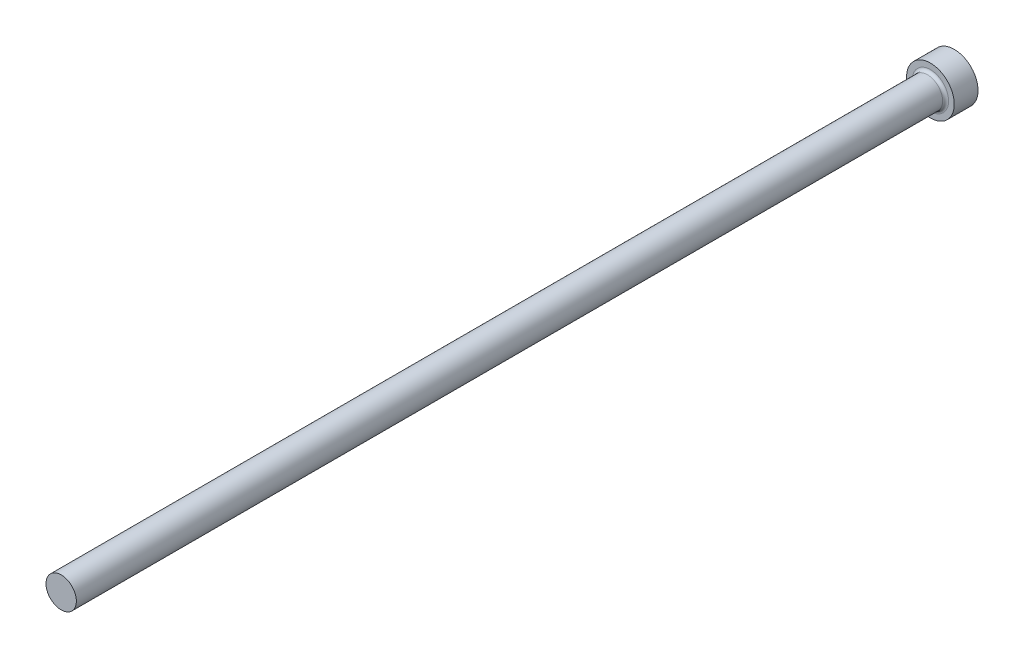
ISO-10303-21;
HEADER;
FILE_DESCRIPTION(('STEP AP214'),'2;1');
FILE_NAME('part.step','',(''),(''),'','','');
FILE_SCHEMA(('AUTOMOTIVE_DESIGN { 1 0 10303 214 1 1 1 1 }'));
ENDSEC;
DATA;
#1=APPLICATION_CONTEXT('core data for automotive mechanical design processes');
#2=APPLICATION_PROTOCOL_DEFINITION('international standard','automotive_design',2000,#1);
#3=PRODUCT_CONTEXT('',#1,'mechanical');
#4=PRODUCT('Part','Part','',(#3));
#5=PRODUCT_RELATED_PRODUCT_CATEGORY('part','',(#4));
#6=PRODUCT_DEFINITION_FORMATION('','',#4);
#7=PRODUCT_DEFINITION_CONTEXT('part definition',#1,'design');
#8=PRODUCT_DEFINITION('design','',#6,#7);
#9=PRODUCT_DEFINITION_SHAPE('','',#8);
#10=(LENGTH_UNIT() NAMED_UNIT(*) SI_UNIT(.MILLI.,.METRE.));
#11=(NAMED_UNIT(*) PLANE_ANGLE_UNIT() SI_UNIT($,.RADIAN.));
#12=(NAMED_UNIT(*) SI_UNIT($,.STERADIAN.) SOLID_ANGLE_UNIT());
#13=UNCERTAINTY_MEASURE_WITH_UNIT(LENGTH_MEASURE(1.E-05),#10,'distance_accuracy_value','');
#14=(GEOMETRIC_REPRESENTATION_CONTEXT(3) GLOBAL_UNCERTAINTY_ASSIGNED_CONTEXT((#13)) GLOBAL_UNIT_ASSIGNED_CONTEXT((#10,
#11,#12)) REPRESENTATION_CONTEXT('',''));
#15=CARTESIAN_POINT('',(0.,0.,0.));
#16=DIRECTION('',(0.,0.,1.));
#17=DIRECTION('',(1.,0.,0.));
#18=AXIS2_PLACEMENT_3D('',#15,#16,#17);
#19=CARTESIAN_POINT('',(4.,0.,4.));
#20=DIRECTION('',(0.,0.,-1.));
#21=DIRECTION('',(-1.,0.,0.));
#22=AXIS2_PLACEMENT_3D('',#19,#20,#21);
#23=PLANE('',#22);
#24=CARTESIAN_POINT('',(0.,0.,4.));
#25=DIRECTION('',(0.,0.,-1.));
#26=DIRECTION('',(-1.,0.,0.));
#27=AXIS2_PLACEMENT_3D('',#24,#25,#26);
#28=CIRCLE('',#27,3.05000000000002);
#29=CARTESIAN_POINT('',(-3.05000000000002,0.,4.));
#30=VERTEX_POINT('',#29);
#31=EDGE_CURVE('E40',#30,#30,#28,.T.);
#32=ORIENTED_EDGE('',*,*,#31,.T.);
#33=EDGE_LOOP('',(#32));
#34=FACE_BOUND('',#33,.T.);
#35=CARTESIAN_POINT('',(0.,0.,4.));
#36=DIRECTION('',(0.,0.,-1.));
#37=DIRECTION('',(-1.,0.,0.));
#38=AXIS2_PLACEMENT_3D('',#35,#36,#37);
#39=CIRCLE('',#38,4.);
#40=CARTESIAN_POINT('',(-4.,0.,4.));
#41=VERTEX_POINT('',#40);
#42=EDGE_CURVE('E44',#41,#41,#39,.T.);
#43=ORIENTED_EDGE('',*,*,#42,.F.);
#44=EDGE_LOOP('',(#43));
#45=FACE_BOUND('',#44,.T.);
#46=ADVANCED_FACE('F33',(#34,#45),#23,.F.);
#47=CARTESIAN_POINT('',(0.,0.,-9.03322817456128));
#48=DIRECTION('',(0.,0.,-1.));
#49=DIRECTION('',(-1.,0.,0.));
#50=AXIS2_PLACEMENT_3D('',#47,#48,#49);
#51=CYLINDRICAL_SURFACE('',#50,4.);
#52=CARTESIAN_POINT('',(0.,0.,0.));
#53=DIRECTION('',(0.,0.,-1.));
#54=DIRECTION('',(-1.,0.,0.));
#55=AXIS2_PLACEMENT_3D('',#52,#53,#54);
#56=CIRCLE('',#55,4.);
#57=CARTESIAN_POINT('',(-4.,0.,0.));
#58=VERTEX_POINT('',#57);
#59=EDGE_CURVE('E48',#58,#58,#56,.T.);
#60=ORIENTED_EDGE('',*,*,#59,.F.);
#61=EDGE_LOOP('',(#60));
#62=FACE_BOUND('',#61,.T.);
#63=ORIENTED_EDGE('',*,*,#42,.T.);
#64=EDGE_LOOP('',(#63));
#65=FACE_BOUND('',#64,.T.);
#66=ADVANCED_FACE('F68',(#62,#65),#51,.T.);
#67=CARTESIAN_POINT('',(0.,0.,0.));
#68=DIRECTION('',(0.,0.,1.));
#69=DIRECTION('',(1.,0.,0.));
#70=AXIS2_PLACEMENT_3D('',#67,#68,#69);
#71=PLANE('',#70);
#72=ORIENTED_EDGE('',*,*,#59,.T.);
#73=EDGE_LOOP('',(#72));
#74=FACE_BOUND('',#73,.T.);
#75=ADVANCED_FACE('F61',(#74),#71,.F.);
#76=CARTESIAN_POINT('',(0.,0.,150.));
#77=DIRECTION('',(0.,0.,-1.));
#78=DIRECTION('',(-1.,0.,0.));
#79=AXIS2_PLACEMENT_3D('',#76,#77,#78);
#80=PLANE('',#79);
#81=CARTESIAN_POINT('',(0.,0.,150.));
#82=DIRECTION('',(0.,0.,-1.));
#83=DIRECTION('',(-1.,0.,0.));
#84=AXIS2_PLACEMENT_3D('',#81,#82,#83);
#85=CIRCLE('',#84,2.55000000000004);
#86=CARTESIAN_POINT('',(-2.55000000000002,0.,150.));
#87=VERTEX_POINT('',#86);
#88=EDGE_CURVE('E53',#87,#87,#85,.T.);
#89=ORIENTED_EDGE('',*,*,#88,.F.);
#90=EDGE_LOOP('',(#89));
#91=FACE_BOUND('',#90,.T.);
#92=ADVANCED_FACE('F59',(#91),#80,.F.);
#93=CARTESIAN_POINT('',(0.,0.,-9.03322817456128));
#94=DIRECTION('',(0.,0.,-1.));
#95=DIRECTION('',(-1.,0.,0.));
#96=AXIS2_PLACEMENT_3D('',#93,#94,#95);
#97=CYLINDRICAL_SURFACE('',#96,2.55000000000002);
#98=CARTESIAN_POINT('',(0.,0.,4.5));
#99=DIRECTION('',(0.,0.,-1.));
#100=DIRECTION('',(-1.,0.,0.));
#101=AXIS2_PLACEMENT_3D('',#98,#99,#100);
#102=CIRCLE('',#101,2.55000000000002);
#103=CARTESIAN_POINT('',(-2.55000000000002,0.,4.5));
#104=VERTEX_POINT('',#103);
#105=EDGE_CURVE('E10',#104,#104,#102,.F.);
#106=ORIENTED_EDGE('',*,*,#105,.T.);
#107=EDGE_LOOP('',(#106));
#108=FACE_BOUND('',#107,.T.);
#109=ORIENTED_EDGE('',*,*,#88,.T.);
#110=EDGE_LOOP('',(#109));
#111=FACE_BOUND('',#110,.T.);
#112=ADVANCED_FACE('F57',(#108,#111),#97,.T.);
#113=CARTESIAN_POINT('',(0.,0.,4.5));
#114=DIRECTION('',(0.,0.,-1.));
#115=DIRECTION('',(-1.,0.,0.));
#116=AXIS2_PLACEMENT_3D('',#113,#114,#115);
#117=TOROIDAL_SURFACE('',#116,3.05000000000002,0.5);
#118=ORIENTED_EDGE('',*,*,#105,.F.);
#119=EDGE_LOOP('',(#118));
#120=FACE_BOUND('',#119,.T.);
#121=ORIENTED_EDGE('',*,*,#31,.F.);
#122=EDGE_LOOP('',(#121));
#123=FACE_BOUND('',#122,.T.);
#124=ADVANCED_FACE('F35',(#120,#123),#117,.F.);
#125=CLOSED_SHELL('',(#46,#66,#75,#92,#112,#124));
#126=MANIFOLD_SOLID_BREP('B2',#125);
#127=ADVANCED_BREP_SHAPE_REPRESENTATION('',(#18,#126),#14);
#128=SHAPE_DEFINITION_REPRESENTATION(#9,#127);
ENDSEC;
END-ISO-10303-21;
